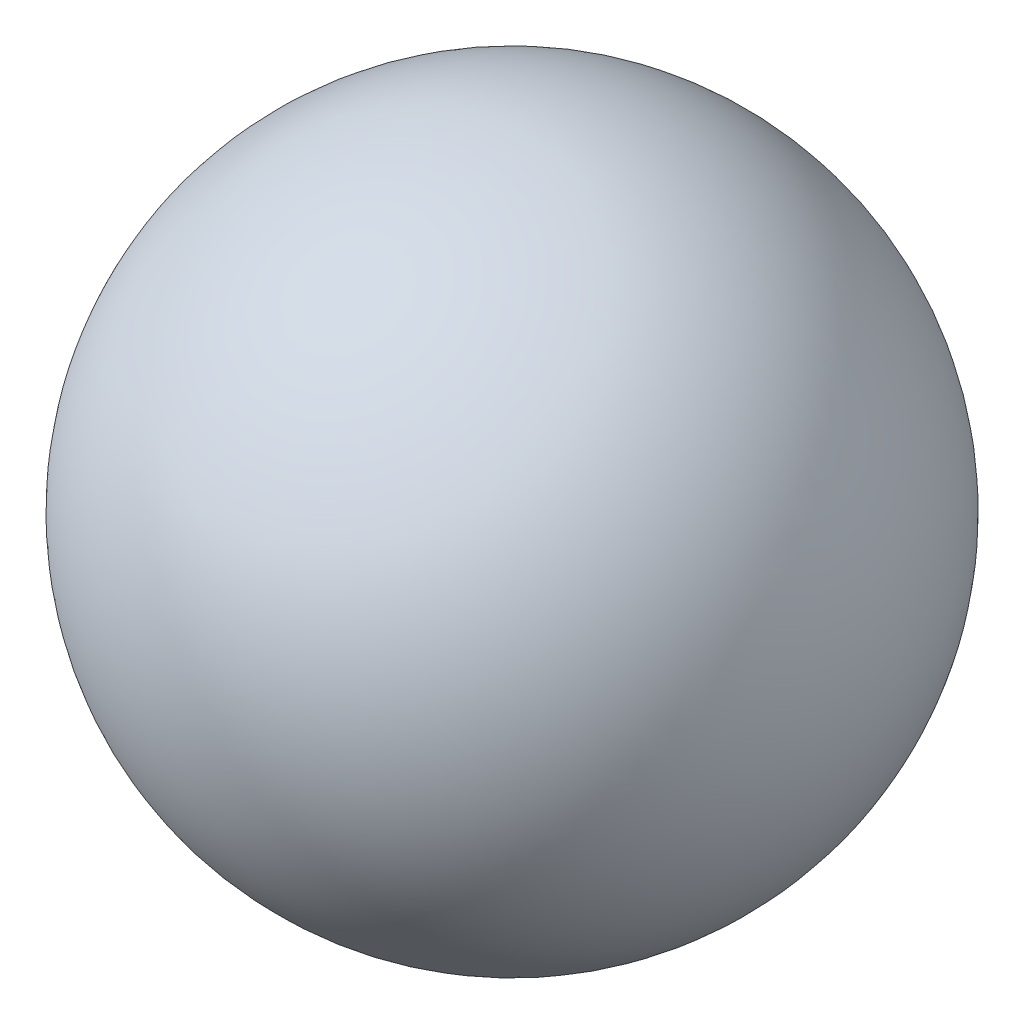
ISO-10303-21;
HEADER;
FILE_DESCRIPTION(('STEP AP214'),'2;1');
FILE_NAME('part.step','',(''),(''),'','','');
FILE_SCHEMA(('AUTOMOTIVE_DESIGN { 1 0 10303 214 1 1 1 1 }'));
ENDSEC;
DATA;
#1=APPLICATION_CONTEXT('core data for automotive mechanical design processes');
#2=APPLICATION_PROTOCOL_DEFINITION('international standard','automotive_design',2000,#1);
#3=PRODUCT_CONTEXT('',#1,'mechanical');
#4=PRODUCT('Part','Part','',(#3));
#5=PRODUCT_RELATED_PRODUCT_CATEGORY('part','',(#4));
#6=PRODUCT_DEFINITION_FORMATION('','',#4);
#7=PRODUCT_DEFINITION_CONTEXT('part definition',#1,'design');
#8=PRODUCT_DEFINITION('design','',#6,#7);
#9=PRODUCT_DEFINITION_SHAPE('','',#8);
#10=(LENGTH_UNIT() NAMED_UNIT(*) SI_UNIT(.MILLI.,.METRE.));
#11=(NAMED_UNIT(*) PLANE_ANGLE_UNIT() SI_UNIT($,.RADIAN.));
#12=(NAMED_UNIT(*) SI_UNIT($,.STERADIAN.) SOLID_ANGLE_UNIT());
#13=UNCERTAINTY_MEASURE_WITH_UNIT(LENGTH_MEASURE(1.E-05),#10,'distance_accuracy_value','');
#14=(GEOMETRIC_REPRESENTATION_CONTEXT(3) GLOBAL_UNCERTAINTY_ASSIGNED_CONTEXT((#13)) GLOBAL_UNIT_ASSIGNED_CONTEXT((#10,
#11,#12)) REPRESENTATION_CONTEXT('',''));
#15=CARTESIAN_POINT('',(0.,0.,0.));
#16=DIRECTION('',(0.,0.,1.));
#17=DIRECTION('',(1.,0.,0.));
#18=AXIS2_PLACEMENT_3D('',#15,#16,#17);
#19=CARTESIAN_POINT('',(9.5,25.5,0.));
#20=DIRECTION('',(1.,0.,0.));
#21=DIRECTION('',(0.,1.,0.));
#22=AXIS2_PLACEMENT_3D('',#19,#20,#21);
#23=SPHERICAL_SURFACE('',#22,6.747);
#24=CARTESIAN_POINT('',(16.247,25.5,0.));
#25=VERTEX_POINT('',#24);
#26=VERTEX_LOOP('',#25);
#27=FACE_BOUND('',#26,.T.);
#28=ADVANCED_FACE('F27',(#27),#23,.T.);
#29=CLOSED_SHELL('',(#28));
#30=MANIFOLD_SOLID_BREP('B2',#29);
#31=ADVANCED_BREP_SHAPE_REPRESENTATION('',(#18,#30),#14);
#32=SHAPE_DEFINITION_REPRESENTATION(#9,#31);
ENDSEC;
END-ISO-10303-21;
